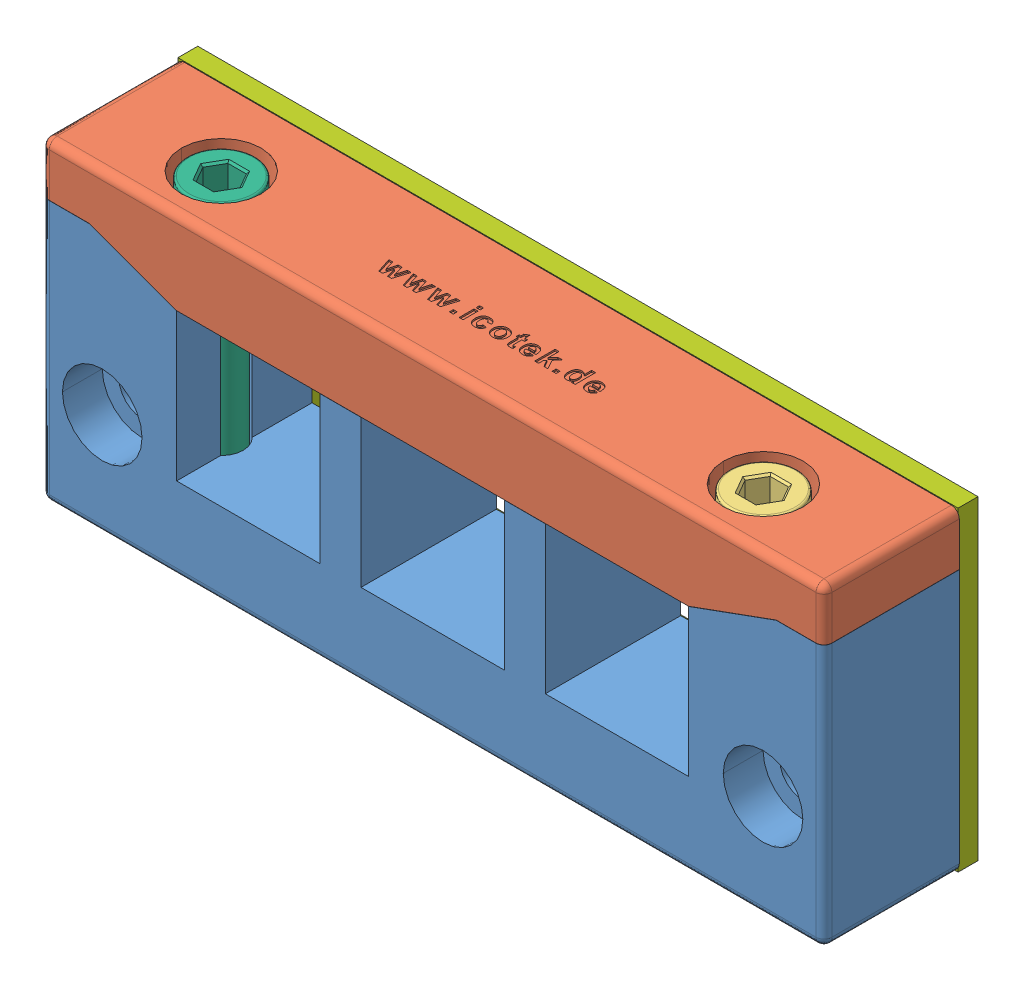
SolidWorks assembly 70012_200.SLDASM, configuration Default (file format 8000). Lengths in mm.
Overall size (98.3 39.6 19.5).
7 component instances, 7 part files, 0 mates.
Components (placement in the parent):
- 70012_200_01-1: 70012_200_01.SLDPRT [Default] at origin size (98.3 32.98 17)
- 70012_200_02-1: 70012_200_02.SLDPRT [Default] at origin size (98.3 10.5 17)
- 70012_200_03-1: 70012_200_03.SLDPRT [Default] at origin size (8.5 35 8.5)
- 70012_200_04-1: 70012_200_04.SLDPRT [Default] at origin size (9.25 4.7 8.01)
- 70012_200_05-1: 70012_200_05.SLDPRT [Default] at origin size (9.25 4.7 8.01)
- 70012_200_06-1: 70012_200_06.SLDPRT [Default] at origin size (8.5 35 8.5)
- 70012_200_07-1: 70012_200_07.SLDPRT [Default] at origin size (98 39.6 2.5)
